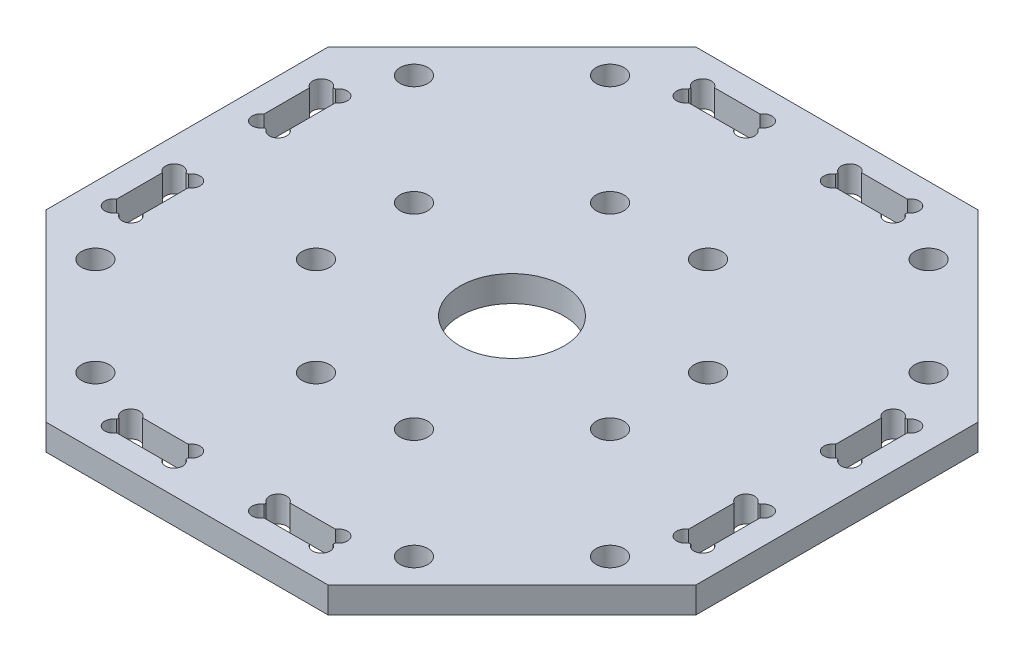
from build123d import *

# Parameters (mm, degrees)
SKETCH_1_W              = 75
SKETCH_1_H              = 75
SKETCH_1_R              = 6
EXTRUDE_1_DEPTH         = 3
HOLE_WIZARD_3_2_3_2_1_D = 3.2
SKETCH_4_W              = 3
SKETCH_4_H              = 8
SKETCH_4_W_2            = 8
SKETCH_4_H_2            = 3
CUT_EXTRUDE_1_DEPTH     = 10
CUT_EXTRUDE_2_DEPTH     = 10
HOLE_WIZARD_2_0_2_1_D   = 2


with BuildPart() as part:
    # Sketch 1 → Extrude 1 (new body)
    with BuildSketch(Plane(origin=(0, 0, 0), x_dir=(1, 0, 0), z_dir=(0, 1, 0))):
        Rectangle(SKETCH_1_W, SKETCH_1_H)
        with Locations(Location((0, 0, 0), (0, 0, 270))):
            Circle(SKETCH_1_R, mode=Mode.SUBTRACT)
    extrude(amount=EXTRUDE_1_DEPTH)

    # Hole Wizard 3.2 _3.2_ _1 (through all)
    with Locations(Plane(origin=(0, 3, 0), x_dir=(1, 0, 0), z_dir=(0, 1, 0))):
        with Locations((18.384776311, 29.69848481), (16.970562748, -5.656854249), (5.656854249, -16.970562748), (29.69848481, -18.384776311), (18.384776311, -29.69848481), (-29.69848481, 18.384776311), (-18.384776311, 29.69848481), (-5.656854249, 16.970562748), (-16.970562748, 5.656854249), (-5.656854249, -16.970562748), (-18.384776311, -29.69848481), (-29.69848481, -18.384776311), (-16.970562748, -5.656854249), (5.656854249, 16.970562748), (16.970562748, 5.656854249), (29.69848481, 18.384776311)):
            Hole(HOLE_WIZARD_3_2_3_2_1_D / 2)

    # Sketch 4 → Cut-Extrude 1 (cut)
    with BuildSketch(Plane(origin=(0, 3, 0), x_dir=(1, 0, 0), z_dir=(0, 1, 0))):
        with Locations((-33, -8.5)):
            Rectangle(SKETCH_4_W, SKETCH_4_H)
        with Locations((-33, 8.5)):
            Rectangle(SKETCH_4_W, SKETCH_4_H)
        with Locations((8.5, 33)):
            Rectangle(SKETCH_4_W_2, SKETCH_4_H_2)
        with Locations((-8.5, 33)):
            Rectangle(SKETCH_4_W_2, SKETCH_4_H_2)
        with Locations((33, 8.5)):
            Rectangle(SKETCH_4_W, SKETCH_4_H)
        with Locations((33, -8.5)):
            Rectangle(SKETCH_4_W, SKETCH_4_H)
        with Locations((-8.5, -33)):
            Rectangle(SKETCH_4_W_2, SKETCH_4_H_2)
        with Locations((8.5, -33)):
            Rectangle(SKETCH_4_W_2, SKETCH_4_H_2)
    extrude(amount=-CUT_EXTRUDE_1_DEPTH, mode=Mode.SUBTRACT)

    # Sketch 5 → Cut-Extrude 2 (cut)
    with BuildSketch(Plane(origin=(0, 3, 0), x_dir=(1, 0, 0), z_dir=(0, 1, 0))):
        Polygon((-16.286796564, 37.5), (-37.5, 16.286796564), (-37.5, 37.5), align=None)
        Polygon((37.5, 37.5), (16.286796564, 37.5), (37.5, 16.286796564), align=None)
        Polygon((16.286796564, -37.5), (37.5, -16.286796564), (37.5, -37.5), align=None)
        Polygon((-37.5, -37.5), (-16.286796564, -37.5), (-37.5, -16.286796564), align=None)
    extrude(amount=-CUT_EXTRUDE_2_DEPTH, mode=Mode.SUBTRACT)

    # Hole Wizard 2.0 _2_ _1 (through all)
    with Locations(Plane(origin=(0, 3, 0), x_dir=(1, 0, 0), z_dir=(0, 1, 0))):
        with Locations((-12, 32), (-12, 34), (-5, 34), (-5, 32), (5, 32), (5, 34), (12, 34), (12, 32), (-32, 5), (-34, 5), (-34, 12), (-32, 12), (-32, -12), (-34, -12), (-34, -5), (-32, -5), (32, -5), (34, -5), (34, -12), (32, -12), (32, 12), (34, 12), (34, 5), (32, 5), (-5, -32), (-5, -34), (-12, -34), (-12, -32), (12, -32), (12, -34), (5, -34), (5, -32)):
            Hole(HOLE_WIZARD_2_0_2_1_D / 2)


solid = part.part
